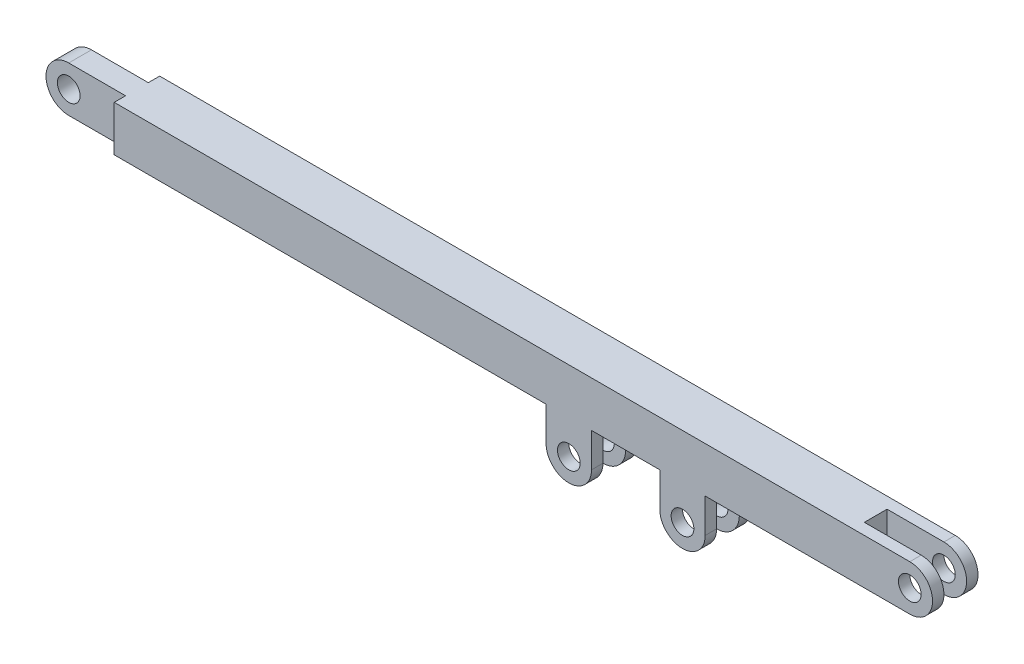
from build123d import *

# Parameters (mm, degrees)
SZKIC1_R                    = 20
DODANIE_WYCI_GNI_CIE1_DEPTH = 20
SZKIC2_R                    = 20
DODANIE_WYCI_GNI_CIE2_DEPTH = 40
SZKIC3_R                    = 20
WYTNIJ_WYCI_GNI_CIE1_DEPTH  = 20
SZKIC4_R                    = 20
DODANIE_WYCI_GNI_CIE3_DEPTH = 40
SZKIC4_2_R                  = 20
WYTNIJ_WYCI_GNI_CIE2_DEPTH  = 20
SZYK_LINIOWY1_COUNT         = 2
SZYK_LINIOWY1_PITCH         = 200


with BuildPart() as part:
    # Szkic1 → Dodanie-wyci_gni_cie1 (new, symmetric)
    with BuildSketch(Plane.XY):
        with BuildLine():
            Line((0, 40), (1500, 40))
            ThreePointArc((1500, 40), (1540, 0), (1500, -40))
            Line((1500, -40), (0, -40))
            ThreePointArc((0, -40), (-40, 0), (0, 40))
        make_face()
        Circle(SZKIC1_R, mode=Mode.SUBTRACT)
        with Locations((1500, 0)):
            Circle(SZKIC1_R, mode=Mode.SUBTRACT)
    extrude(amount=DODANIE_WYCI_GNI_CIE1_DEPTH, both=True)

    # Szkic2 → Dodanie-wyci_gni_cie2 (add, symmetric)
    with BuildSketch(Plane.XY):
        with BuildLine():
            Line((100, 40), (1500, 40))
            ThreePointArc((1500, 40), (1540, 0), (1500, -40))
            Line((1500, -40), (100, -40))
            Line((100, -40), (100, 40))
        make_face()
        with Locations((1500, 0)):
            Circle(SZKIC2_R, mode=Mode.SUBTRACT)
    extrude(amount=DODANIE_WYCI_GNI_CIE2_DEPTH, both=True)

    # Szkic3 → Wytnij-wyci_gni_cie1 (cut, symmetric)
    with BuildSketch(Plane.XY):
        with BuildLine():
            Line((1400, 40), (1500, 40))
            ThreePointArc((1500, 40), (1540, 0), (1500, -40))
            Line((1500, -40), (1400, -40))
            Line((1400, -40), (1400, 40))
        make_face()
        with Locations((1500, 0)):
            Circle(SZKIC3_R, mode=Mode.SUBTRACT)
    extrude(amount=WYTNIJ_WYCI_GNI_CIE1_DEPTH, both=True, mode=Mode.SUBTRACT)

    # Szkic4 → Dodanie-wyci_gni_cie3 (add, symmetric)
    with BuildSketch(Plane.XY):
        with BuildLine():
            Line((1060, -40), (1140, -40))
            Line((1140, -40), (1140, -100))
            ThreePointArc((1140, -100), (1100, -140), (1060, -100))
            Line((1060, -100), (1060, -40))
        make_face()
        with Locations((1100, -100)):
            Circle(SZKIC4_R, mode=Mode.SUBTRACT)
    dodanie_wyci_gni_cie3 = extrude(amount=DODANIE_WYCI_GNI_CIE3_DEPTH, both=True)

    # Szkic4_2 → Wytnij-wyci_gni_cie2 (cut, symmetric)
    with BuildSketch(Plane.XY):
        with BuildLine():
            Line((1060, -40), (1140, -40))
            Line((1140, -40), (1140, -100))
            ThreePointArc((1140, -100), (1100, -140), (1060, -100))
            Line((1060, -100), (1060, -40))
        make_face()
        with Locations((1100, -100)):
            Circle(SZKIC4_2_R, mode=Mode.SUBTRACT)
    wytnij_wyci_gni_cie2 = extrude(amount=WYTNIJ_WYCI_GNI_CIE2_DEPTH, both=True, mode=Mode.SUBTRACT)

    # Szyk liniowy1: Dodanie-wyci_gni_cie3, Wytnij-wyci_gni_cie2 ×2
    with Locations(*[(-i * SZYK_LINIOWY1_PITCH, 0, 0) for i in range(1, SZYK_LINIOWY1_COUNT)]):
        add(dodanie_wyci_gni_cie3)
        add(wytnij_wyci_gni_cie2, mode=Mode.SUBTRACT)


solid = part.part
